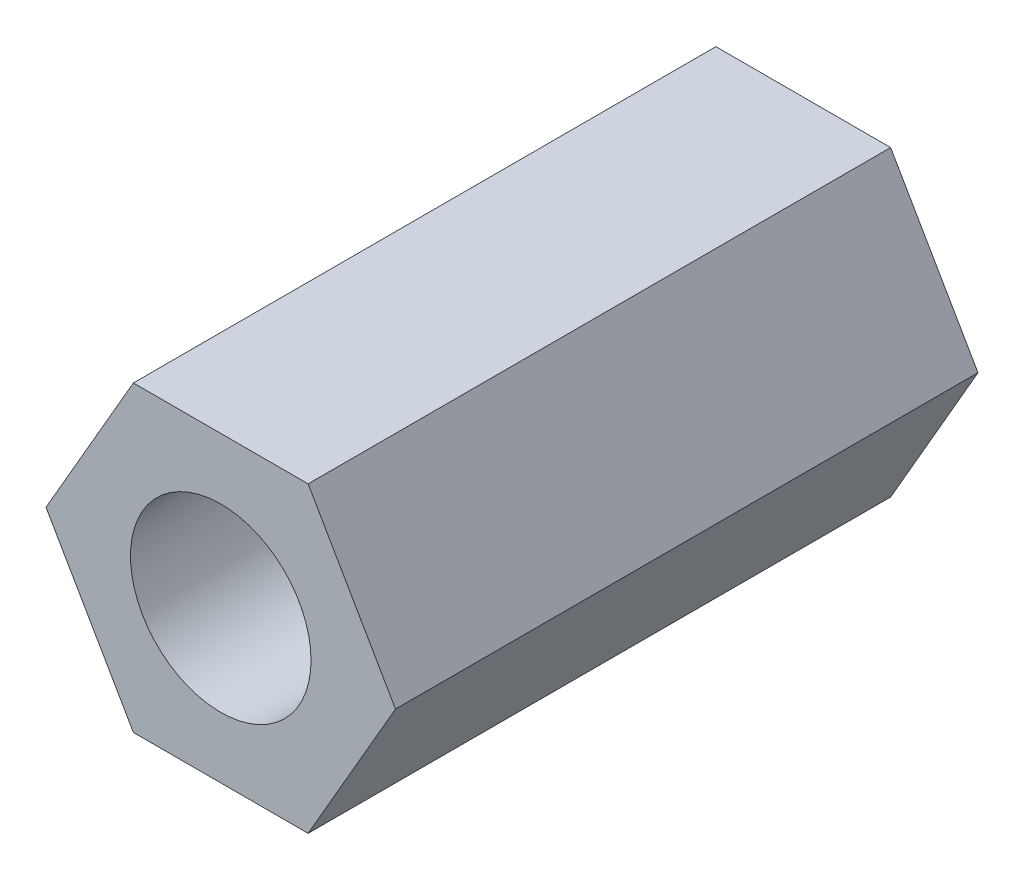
ISO-10303-21;
HEADER;
FILE_DESCRIPTION(('STEP AP214'),'2;1');
FILE_NAME('part.step','',(''),(''),'','','');
FILE_SCHEMA(('AUTOMOTIVE_DESIGN { 1 0 10303 214 1 1 1 1 }'));
ENDSEC;
DATA;
#1=APPLICATION_CONTEXT('core data for automotive mechanical design processes');
#2=APPLICATION_PROTOCOL_DEFINITION('international standard','automotive_design',2000,#1);
#3=PRODUCT_CONTEXT('',#1,'mechanical');
#4=PRODUCT('Part','Part','',(#3));
#5=PRODUCT_RELATED_PRODUCT_CATEGORY('part','',(#4));
#6=PRODUCT_DEFINITION_FORMATION('','',#4);
#7=PRODUCT_DEFINITION_CONTEXT('part definition',#1,'design');
#8=PRODUCT_DEFINITION('design','',#6,#7);
#9=PRODUCT_DEFINITION_SHAPE('','',#8);
#10=(LENGTH_UNIT() NAMED_UNIT(*) SI_UNIT(.MILLI.,.METRE.));
#11=(NAMED_UNIT(*) PLANE_ANGLE_UNIT() SI_UNIT($,.RADIAN.));
#12=(NAMED_UNIT(*) SI_UNIT($,.STERADIAN.) SOLID_ANGLE_UNIT());
#13=UNCERTAINTY_MEASURE_WITH_UNIT(LENGTH_MEASURE(1.E-05),#10,'distance_accuracy_value','');
#14=(GEOMETRIC_REPRESENTATION_CONTEXT(3) GLOBAL_UNCERTAINTY_ASSIGNED_CONTEXT((#13)) GLOBAL_UNIT_ASSIGNED_CONTEXT((#10,
#11,#12)) REPRESENTATION_CONTEXT('',''));
#15=CARTESIAN_POINT('',(0.,0.,0.));
#16=DIRECTION('',(0.,0.,1.));
#17=DIRECTION('',(1.,0.,0.));
#18=AXIS2_PLACEMENT_3D('',#15,#16,#17);
#19=CARTESIAN_POINT('',(0.,0.,10.));
#20=DIRECTION('',(0.,0.,1.));
#21=DIRECTION('',(1.,0.,0.));
#22=AXIS2_PLACEMENT_3D('',#19,#20,#21);
#23=PLANE('',#22);
#24=DIRECTION('',(0.5,0.866025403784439,0.));
#25=VECTOR('',#24,1.);
#26=CARTESIAN_POINT('',(1.5,-2.59807621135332,10.));
#27=LINE('',#26,#25);
#28=CARTESIAN_POINT('',(1.5,-2.59807621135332,10.));
#29=VERTEX_POINT('',#28);
#30=CARTESIAN_POINT('',(3.,0.,10.));
#31=VERTEX_POINT('',#30);
#32=EDGE_CURVE('E146',#29,#31,#27,.T.);
#33=ORIENTED_EDGE('',*,*,#32,.T.);
#34=DIRECTION('',(-0.5,0.866025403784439,0.));
#35=VECTOR('',#34,1.);
#36=CARTESIAN_POINT('',(3.,0.,10.));
#37=LINE('',#36,#35);
#38=CARTESIAN_POINT('',(1.5,2.59807621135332,10.));
#39=VERTEX_POINT('',#38);
#40=EDGE_CURVE('E94',#31,#39,#37,.T.);
#41=ORIENTED_EDGE('',*,*,#40,.T.);
#42=DIRECTION('',(-1.,0.,0.));
#43=VECTOR('',#42,1.);
#44=CARTESIAN_POINT('',(1.5,2.59807621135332,10.));
#45=LINE('',#44,#43);
#46=CARTESIAN_POINT('',(-1.5,2.59807621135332,10.));
#47=VERTEX_POINT('',#46);
#48=EDGE_CURVE('E107',#39,#47,#45,.T.);
#49=ORIENTED_EDGE('',*,*,#48,.T.);
#50=DIRECTION('',(-0.5,-0.866025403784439,0.));
#51=VECTOR('',#50,1.);
#52=CARTESIAN_POINT('',(-1.5,2.59807621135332,10.));
#53=LINE('',#52,#51);
#54=CARTESIAN_POINT('',(-3.,0.,10.));
#55=VERTEX_POINT('',#54);
#56=EDGE_CURVE('E101',#47,#55,#53,.T.);
#57=ORIENTED_EDGE('',*,*,#56,.T.);
#58=DIRECTION('',(0.5,-0.866025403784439,0.));
#59=VECTOR('',#58,1.);
#60=CARTESIAN_POINT('',(-3.,0.,10.));
#61=LINE('',#60,#59);
#62=CARTESIAN_POINT('',(-1.5,-2.59807621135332,10.));
#63=VERTEX_POINT('',#62);
#64=EDGE_CURVE('E105',#55,#63,#61,.T.);
#65=ORIENTED_EDGE('',*,*,#64,.T.);
#66=DIRECTION('',(1.,0.,0.));
#67=VECTOR('',#66,1.);
#68=CARTESIAN_POINT('',(-1.5,-2.59807621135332,10.));
#69=LINE('',#68,#67);
#70=EDGE_CURVE('E57',#63,#29,#69,.T.);
#71=ORIENTED_EDGE('',*,*,#70,.T.);
#72=EDGE_LOOP('',(#33,#41,#49,#57,#65,#71));
#73=FACE_BOUND('',#72,.T.);
#74=CARTESIAN_POINT('',(0.,0.,10.));
#75=DIRECTION('',(0.,0.,1.));
#76=DIRECTION('',(1.,0.,0.));
#77=AXIS2_PLACEMENT_3D('',#74,#75,#76);
#78=CIRCLE('',#77,1.55);
#79=CARTESIAN_POINT('',(1.55,0.,10.));
#80=VERTEX_POINT('',#79);
#81=EDGE_CURVE('E134',#80,#80,#78,.T.);
#82=ORIENTED_EDGE('',*,*,#81,.F.);
#83=EDGE_LOOP('',(#82));
#84=FACE_BOUND('',#83,.T.);
#85=ADVANCED_FACE('F39',(#73,#84),#23,.T.);
#86=CARTESIAN_POINT('',(0.,0.,0.));
#87=DIRECTION('',(0.,0.,1.));
#88=DIRECTION('',(1.,0.,0.));
#89=AXIS2_PLACEMENT_3D('',#86,#87,#88);
#90=PLANE('',#89);
#91=DIRECTION('',(0.5,0.866025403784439,0.));
#92=VECTOR('',#91,1.);
#93=CARTESIAN_POINT('',(1.5,-2.59807621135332,0.));
#94=LINE('',#93,#92);
#95=CARTESIAN_POINT('',(1.5,-2.59807621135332,0.));
#96=VERTEX_POINT('',#95);
#97=CARTESIAN_POINT('',(3.,0.,0.));
#98=VERTEX_POINT('',#97);
#99=EDGE_CURVE('E129',#96,#98,#94,.T.);
#100=ORIENTED_EDGE('',*,*,#99,.F.);
#101=DIRECTION('',(1.,0.,0.));
#102=VECTOR('',#101,1.);
#103=CARTESIAN_POINT('',(-1.5,-2.59807621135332,0.));
#104=LINE('',#103,#102);
#105=CARTESIAN_POINT('',(-1.5,-2.59807621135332,0.));
#106=VERTEX_POINT('',#105);
#107=EDGE_CURVE('E86',#106,#96,#104,.T.);
#108=ORIENTED_EDGE('',*,*,#107,.F.);
#109=DIRECTION('',(0.5,-0.866025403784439,0.));
#110=VECTOR('',#109,1.);
#111=CARTESIAN_POINT('',(-3.,0.,0.));
#112=LINE('',#111,#110);
#113=CARTESIAN_POINT('',(-3.,0.,0.));
#114=VERTEX_POINT('',#113);
#115=EDGE_CURVE('E80',#114,#106,#112,.T.);
#116=ORIENTED_EDGE('',*,*,#115,.F.);
#117=DIRECTION('',(-0.5,-0.866025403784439,0.));
#118=VECTOR('',#117,1.);
#119=CARTESIAN_POINT('',(-1.5,2.59807621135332,0.));
#120=LINE('',#119,#118);
#121=CARTESIAN_POINT('',(-1.5,2.59807621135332,0.));
#122=VERTEX_POINT('',#121);
#123=EDGE_CURVE('E116',#122,#114,#120,.T.);
#124=ORIENTED_EDGE('',*,*,#123,.F.);
#125=DIRECTION('',(-1.,0.,0.));
#126=VECTOR('',#125,1.);
#127=CARTESIAN_POINT('',(1.5,2.59807621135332,0.));
#128=LINE('',#127,#126);
#129=CARTESIAN_POINT('',(1.5,2.59807621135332,0.));
#130=VERTEX_POINT('',#129);
#131=EDGE_CURVE('E137',#130,#122,#128,.T.);
#132=ORIENTED_EDGE('',*,*,#131,.F.);
#133=DIRECTION('',(-0.5,0.866025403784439,0.));
#134=VECTOR('',#133,1.);
#135=CARTESIAN_POINT('',(3.,0.,0.));
#136=LINE('',#135,#134);
#137=EDGE_CURVE('E133',#98,#130,#136,.T.);
#138=ORIENTED_EDGE('',*,*,#137,.F.);
#139=EDGE_LOOP('',(#100,#108,#116,#124,#132,#138));
#140=FACE_BOUND('',#139,.T.);
#141=CARTESIAN_POINT('',(0.,0.,0.));
#142=DIRECTION('',(0.,0.,1.));
#143=DIRECTION('',(1.,0.,0.));
#144=AXIS2_PLACEMENT_3D('',#141,#142,#143);
#145=CIRCLE('',#144,1.55);
#146=CARTESIAN_POINT('',(1.55,0.,0.));
#147=VERTEX_POINT('',#146);
#148=EDGE_CURVE('E243',#147,#147,#145,.T.);
#149=ORIENTED_EDGE('',*,*,#148,.T.);
#150=EDGE_LOOP('',(#149));
#151=FACE_BOUND('',#150,.T.);
#152=ADVANCED_FACE('F159',(#140,#151),#90,.F.);
#153=CARTESIAN_POINT('',(1.5,-2.59807621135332,10.));
#154=DIRECTION('',(-0.866025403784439,0.5,0.));
#155=DIRECTION('',(-0.5,-0.866025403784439,0.));
#156=AXIS2_PLACEMENT_3D('',#153,#154,#155);
#157=PLANE('',#156);
#158=ORIENTED_EDGE('',*,*,#99,.T.);
#159=DIRECTION('',(0.,0.,-1.));
#160=VECTOR('',#159,1.);
#161=CARTESIAN_POINT('',(3.,0.,10.));
#162=LINE('',#161,#160);
#163=EDGE_CURVE('E11',#31,#98,#162,.T.);
#164=ORIENTED_EDGE('',*,*,#163,.F.);
#165=ORIENTED_EDGE('',*,*,#32,.F.);
#166=DIRECTION('',(0.,0.,-1.));
#167=VECTOR('',#166,1.);
#168=CARTESIAN_POINT('',(1.5,-2.59807621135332,10.));
#169=LINE('',#168,#167);
#170=EDGE_CURVE('E125',#29,#96,#169,.T.);
#171=ORIENTED_EDGE('',*,*,#170,.T.);
#172=EDGE_LOOP('',(#158,#164,#165,#171));
#173=FACE_BOUND('',#172,.T.);
#174=ADVANCED_FACE('F41',(#173),#157,.F.);
#175=CARTESIAN_POINT('',(3.,0.,10.));
#176=DIRECTION('',(-0.866025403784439,-0.5,0.));
#177=DIRECTION('',(0.5,-0.866025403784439,0.));
#178=AXIS2_PLACEMENT_3D('',#175,#176,#177);
#179=PLANE('',#178);
#180=ORIENTED_EDGE('',*,*,#137,.T.);
#181=DIRECTION('',(0.,0.,-1.));
#182=VECTOR('',#181,1.);
#183=CARTESIAN_POINT('',(1.5,2.59807621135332,10.));
#184=LINE('',#183,#182);
#185=EDGE_CURVE('E49',#39,#130,#184,.T.);
#186=ORIENTED_EDGE('',*,*,#185,.F.);
#187=ORIENTED_EDGE('',*,*,#40,.F.);
#188=ORIENTED_EDGE('',*,*,#163,.T.);
#189=EDGE_LOOP('',(#180,#186,#187,#188));
#190=FACE_BOUND('',#189,.T.);
#191=ADVANCED_FACE('F184',(#190),#179,.F.);
#192=CARTESIAN_POINT('',(1.5,2.59807621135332,10.));
#193=DIRECTION('',(0.,-1.,0.));
#194=DIRECTION('',(0.,0.,-1.));
#195=AXIS2_PLACEMENT_3D('',#192,#193,#194);
#196=PLANE('',#195);
#197=ORIENTED_EDGE('',*,*,#131,.T.);
#198=DIRECTION('',(0.,0.,-1.));
#199=VECTOR('',#198,1.);
#200=CARTESIAN_POINT('',(-1.5,2.59807621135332,10.));
#201=LINE('',#200,#199);
#202=EDGE_CURVE('E118',#47,#122,#201,.T.);
#203=ORIENTED_EDGE('',*,*,#202,.F.);
#204=ORIENTED_EDGE('',*,*,#48,.F.);
#205=ORIENTED_EDGE('',*,*,#185,.T.);
#206=EDGE_LOOP('',(#197,#203,#204,#205));
#207=FACE_BOUND('',#206,.T.);
#208=ADVANCED_FACE('F156',(#207),#196,.F.);
#209=CARTESIAN_POINT('',(-1.5,2.59807621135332,10.));
#210=DIRECTION('',(0.866025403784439,-0.5,0.));
#211=DIRECTION('',(0.5,0.866025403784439,0.));
#212=AXIS2_PLACEMENT_3D('',#209,#210,#211);
#213=PLANE('',#212);
#214=ORIENTED_EDGE('',*,*,#123,.T.);
#215=DIRECTION('',(0.,0.,-1.));
#216=VECTOR('',#215,1.);
#217=CARTESIAN_POINT('',(-3.,0.,10.));
#218=LINE('',#217,#216);
#219=EDGE_CURVE('E113',#55,#114,#218,.T.);
#220=ORIENTED_EDGE('',*,*,#219,.F.);
#221=ORIENTED_EDGE('',*,*,#56,.F.);
#222=ORIENTED_EDGE('',*,*,#202,.T.);
#223=EDGE_LOOP('',(#214,#220,#221,#222));
#224=FACE_BOUND('',#223,.T.);
#225=ADVANCED_FACE('F114',(#224),#213,.F.);
#226=CARTESIAN_POINT('',(-3.,0.,10.));
#227=DIRECTION('',(0.866025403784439,0.5,0.));
#228=DIRECTION('',(-0.5,0.866025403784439,0.));
#229=AXIS2_PLACEMENT_3D('',#226,#227,#228);
#230=PLANE('',#229);
#231=ORIENTED_EDGE('',*,*,#115,.T.);
#232=DIRECTION('',(0.,0.,-1.));
#233=VECTOR('',#232,1.);
#234=CARTESIAN_POINT('',(-1.5,-2.59807621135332,10.));
#235=LINE('',#234,#233);
#236=EDGE_CURVE('E119',#63,#106,#235,.T.);
#237=ORIENTED_EDGE('',*,*,#236,.F.);
#238=ORIENTED_EDGE('',*,*,#64,.F.);
#239=ORIENTED_EDGE('',*,*,#219,.T.);
#240=EDGE_LOOP('',(#231,#237,#238,#239));
#241=FACE_BOUND('',#240,.T.);
#242=ADVANCED_FACE('F121',(#241),#230,.F.);
#243=CARTESIAN_POINT('',(-1.5,-2.59807621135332,10.));
#244=DIRECTION('',(0.,1.,0.));
#245=DIRECTION('',(-1.,0.,0.));
#246=AXIS2_PLACEMENT_3D('',#243,#244,#245);
#247=PLANE('',#246);
#248=ORIENTED_EDGE('',*,*,#107,.T.);
#249=ORIENTED_EDGE('',*,*,#170,.F.);
#250=ORIENTED_EDGE('',*,*,#70,.F.);
#251=ORIENTED_EDGE('',*,*,#236,.T.);
#252=EDGE_LOOP('',(#248,#249,#250,#251));
#253=FACE_BOUND('',#252,.T.);
#254=ADVANCED_FACE('F164',(#253),#247,.F.);
#255=CARTESIAN_POINT('',(0.,0.,10.));
#256=DIRECTION('',(0.,0.,-1.));
#257=DIRECTION('',(-1.,0.,0.));
#258=AXIS2_PLACEMENT_3D('',#255,#256,#257);
#259=CYLINDRICAL_SURFACE('',#258,1.55);
#260=ORIENTED_EDGE('',*,*,#81,.T.);
#261=EDGE_LOOP('',(#260));
#262=FACE_BOUND('',#261,.T.);
#263=ORIENTED_EDGE('',*,*,#148,.F.);
#264=EDGE_LOOP('',(#263));
#265=FACE_BOUND('',#264,.T.);
#266=ADVANCED_FACE('F166',(#262,#265),#259,.F.);
#267=CLOSED_SHELL('',(#85,#152,#174,#191,#208,#225,#242,#254,#266));
#268=MANIFOLD_SOLID_BREP('B2',#267);
#269=ADVANCED_BREP_SHAPE_REPRESENTATION('',(#18,#268),#14);
#270=SHAPE_DEFINITION_REPRESENTATION(#9,#269);
ENDSEC;
END-ISO-10303-21;
